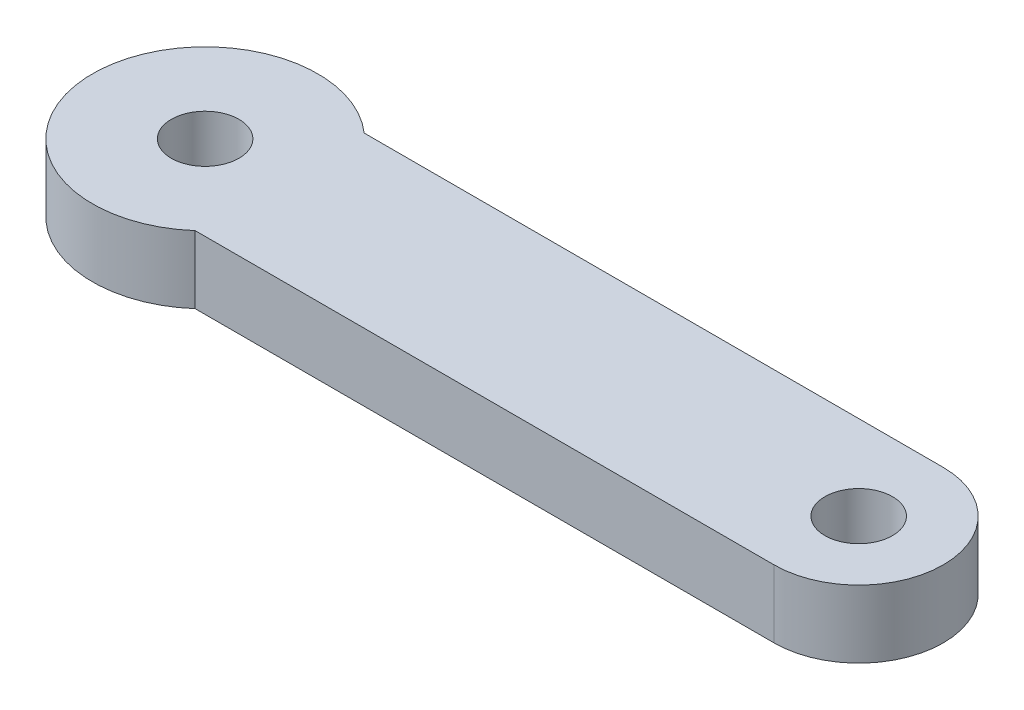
from build123d import *

# Parameters (mm, degrees)
ESQUISSE1_R      = 3
EXTRUSION1_DEPTH = 6


with BuildPart() as part:
    # Esquisse1 → Extrusion1 (new body)
    with BuildSketch(Plane(origin=(0, 0, 0), x_dir=(1, 0, 0), z_dir=(0, 1, 0))):
        with BuildLine():
            Line((58, 7.5), (6.614378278, 7.5))
            ThreePointArc((6.614378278, 7.5), (-10, 0), (6.614378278, -7.5))
            Line((6.614378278, -7.5), (58, -7.5))
            ThreePointArc((58, -7.5), (65.5, 0), (58, 7.5))
        make_face()
        with Locations(Location((0, 0, 0), (0, 0, 270))):
            Circle(ESQUISSE1_R, mode=Mode.SUBTRACT)
        with Locations(Location((58, 0, 0), (0, 0, 270))):
            Circle(ESQUISSE1_R, mode=Mode.SUBTRACT)
    extrude(amount=EXTRUSION1_DEPTH)


solid = part.part
